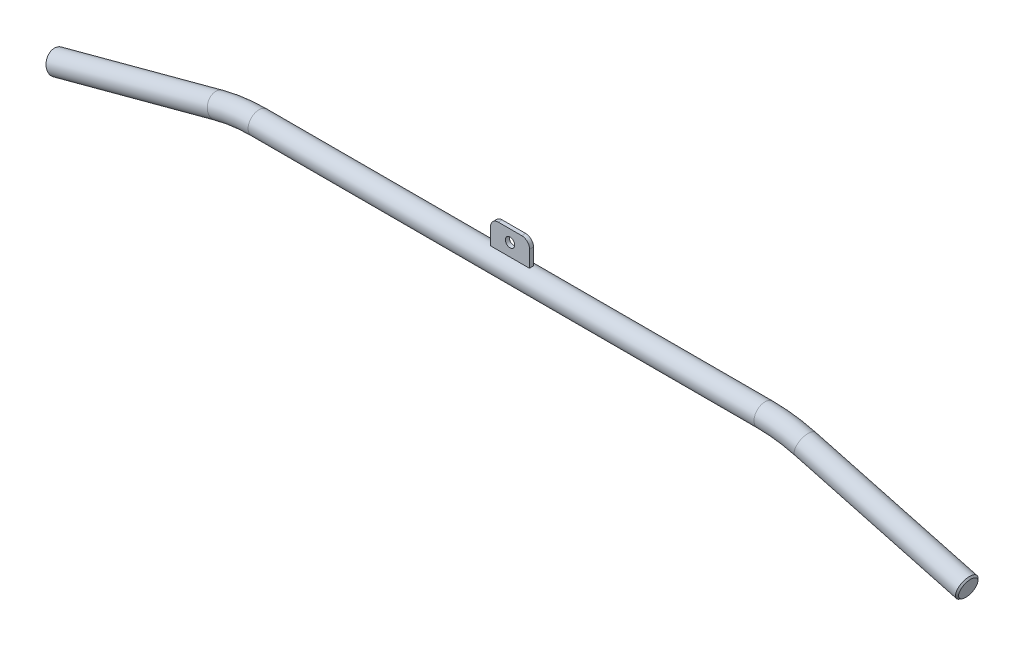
from build123d import *

# Parameters (mm, degrees)
ESQUISSE2_R             = 14
CHANFREIN1_SIZE         = 2
BOSS_EXTRU_1_DEPTH      = 2.5
BOSS_EXTRU_1_DEPTH_BACK = 2.5
ESQUISSE3_R             = 6


with BuildPart() as part:
    # Balayage1: sweep along a path in Esquisse1
    with BuildLine(Plane.XY) as balayage1_path:
        Line((-583.754049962, -62.634208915), (-375.433309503, -6.814834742))
        ThreePointArc((-375.433309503, -6.814834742), (-349.774738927, -1.711027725), (-323.669500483, 0))
        Line((-323.669500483, 0), (323.669500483, 0))
        ThreePointArc((323.669500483, 0), (349.774738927, -1.711027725), (375.433309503, -6.814834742))
        Line((375.433309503, -6.814834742), (583.754049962, -62.634208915))
    # Esquisse2 → Balayage1 (sweep)
    with BuildSketch(Plane(origin=(-583.754049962, -62.634208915, 0), x_dir=(0, 0, 1), z_dir=(-0.9659258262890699, -0.25881904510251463, 0))):
        Circle(ESQUISSE2_R)
    sweep(path=balayage1_path.line)

    # Chanfrein1
    chanfrein1_edges = [part.edges().sort_by_distance(p)[0] for p in [
        (-583.754049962, -62.634208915, -14),
        (583.754049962, -62.634208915, -14),
    ]]
    chamfer(chanfrein1_edges, length=CHANFREIN1_SIZE)

    # Esquisse3 → Boss.-Extru.1 (add, two sides: drawn at the far end of the back side and taken through both)
    with BuildSketch(Plane.XY.offset(-BOSS_EXTRU_1_DEPTH_BACK)):
        with BuildLine():
            Line((-25, 0), (25, 0))
            Line((25, 0), (25, 35))
            ThreePointArc((25, 35), (22.071067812, 42.071067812), (15, 45))
            Line((15, 45), (-15, 45))
            ThreePointArc((-15, 45), (-22.071067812, 42.071067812), (-25, 35))
            Line((-25, 35), (-25, 0))
        make_face()
        with Locations((0, 30)):
            Circle(ESQUISSE3_R, mode=Mode.SUBTRACT)
    extrude(amount=BOSS_EXTRU_1_DEPTH + BOSS_EXTRU_1_DEPTH_BACK)


solid = part.part
